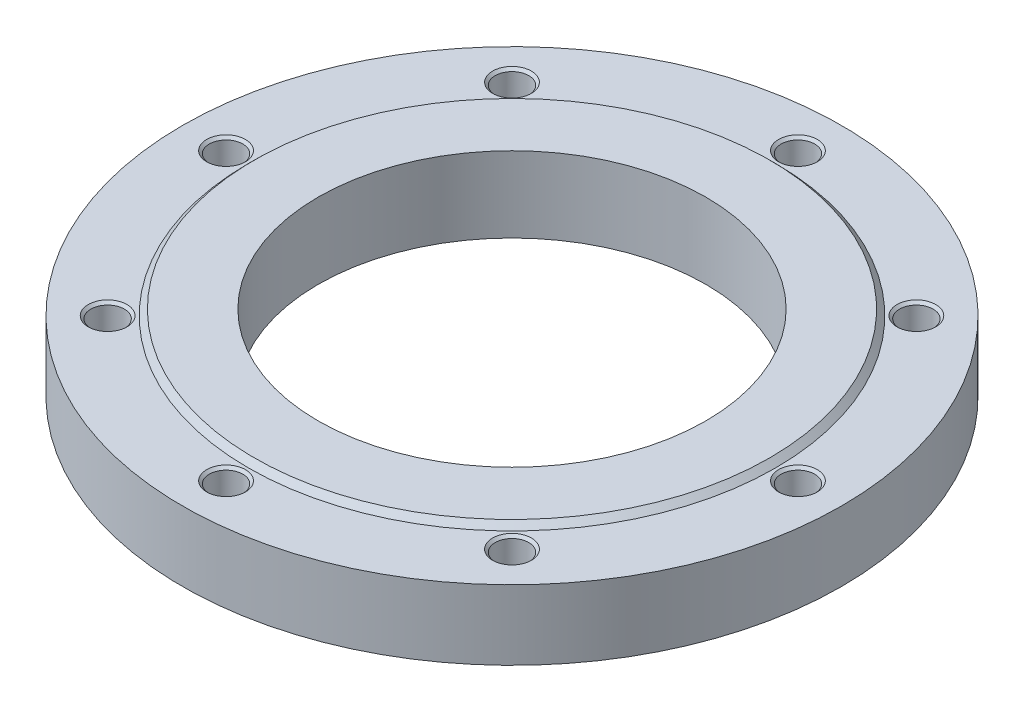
ISO-10303-21;
HEADER;
FILE_DESCRIPTION(('STEP AP214'),'2;1');
FILE_NAME('part.step','',(''),(''),'','','');
FILE_SCHEMA(('AUTOMOTIVE_DESIGN { 1 0 10303 214 1 1 1 1 }'));
ENDSEC;
DATA;
#1=APPLICATION_CONTEXT('core data for automotive mechanical design processes');
#2=APPLICATION_PROTOCOL_DEFINITION('international standard','automotive_design',2000,#1);
#3=PRODUCT_CONTEXT('',#1,'mechanical');
#4=PRODUCT('Part','Part','',(#3));
#5=PRODUCT_RELATED_PRODUCT_CATEGORY('part','',(#4));
#6=PRODUCT_DEFINITION_FORMATION('','',#4);
#7=PRODUCT_DEFINITION_CONTEXT('part definition',#1,'design');
#8=PRODUCT_DEFINITION('design','',#6,#7);
#9=PRODUCT_DEFINITION_SHAPE('','',#8);
#10=(LENGTH_UNIT() NAMED_UNIT(*) SI_UNIT(.MILLI.,.METRE.));
#11=(NAMED_UNIT(*) PLANE_ANGLE_UNIT() SI_UNIT($,.RADIAN.));
#12=(NAMED_UNIT(*) SI_UNIT($,.STERADIAN.) SOLID_ANGLE_UNIT());
#13=UNCERTAINTY_MEASURE_WITH_UNIT(LENGTH_MEASURE(1.E-05),#10,'distance_accuracy_value','');
#14=(GEOMETRIC_REPRESENTATION_CONTEXT(3) GLOBAL_UNCERTAINTY_ASSIGNED_CONTEXT((#13)) GLOBAL_UNIT_ASSIGNED_CONTEXT((#10,
#11,#12)) REPRESENTATION_CONTEXT('',''));
#15=CARTESIAN_POINT('',(0.,0.,0.));
#16=DIRECTION('',(0.,0.,1.));
#17=DIRECTION('',(1.,0.,0.));
#18=AXIS2_PLACEMENT_3D('',#15,#16,#17);
#19=CARTESIAN_POINT('',(0.,18.,0.));
#20=DIRECTION('',(0.,-1.,0.));
#21=DIRECTION('',(1.,0.,0.));
#22=AXIS2_PLACEMENT_3D('',#19,#20,#21);
#23=CYLINDRICAL_SURFACE('',#22,170.);
#24=CARTESIAN_POINT('',(0.,0.,0.));
#25=DIRECTION('',(0.,1.,0.));
#26=DIRECTION('',(1.,0.,0.));
#27=AXIS2_PLACEMENT_3D('',#24,#25,#26);
#28=CIRCLE('',#27,170.);
#29=CARTESIAN_POINT('',(170.,0.,0.));
#30=VERTEX_POINT('',#29);
#31=EDGE_CURVE('E9',#30,#30,#28,.T.);
#32=ORIENTED_EDGE('',*,*,#31,.T.);
#33=EDGE_LOOP('',(#32));
#34=FACE_BOUND('',#33,.T.);
#35=CARTESIAN_POINT('',(0.,36.,0.));
#36=DIRECTION('',(0.,1.,0.));
#37=DIRECTION('',(1.,0.,0.));
#38=AXIS2_PLACEMENT_3D('',#35,#36,#37);
#39=CIRCLE('',#38,170.);
#40=CARTESIAN_POINT('',(170.,36.,0.));
#41=VERTEX_POINT('',#40);
#42=EDGE_CURVE('E313',#41,#41,#39,.T.);
#43=ORIENTED_EDGE('',*,*,#42,.F.);
#44=EDGE_LOOP('',(#43));
#45=FACE_BOUND('',#44,.T.);
#46=ADVANCED_FACE('F15',(#34,#45),#23,.T.);
#47=CARTESIAN_POINT('',(135.,0.,0.));
#48=DIRECTION('',(0.,-1.,0.));
#49=DIRECTION('',(-1.,0.,0.));
#50=AXIS2_PLACEMENT_3D('',#47,#48,#49);
#51=PLANE('',#50);
#52=CARTESIAN_POINT('',(0.,0.,0.));
#53=DIRECTION('',(0.,1.,0.));
#54=DIRECTION('',(1.,0.,0.));
#55=AXIS2_PLACEMENT_3D('',#52,#53,#54);
#56=CIRCLE('',#55,100.);
#57=CARTESIAN_POINT('',(100.,0.,0.));
#58=VERTEX_POINT('',#57);
#59=EDGE_CURVE('E22',#58,#58,#56,.T.);
#60=ORIENTED_EDGE('',*,*,#59,.T.);
#61=EDGE_LOOP('',(#60));
#62=FACE_BOUND('',#61,.T.);
#63=ORIENTED_EDGE('',*,*,#31,.F.);
#64=EDGE_LOOP('',(#63));
#65=FACE_BOUND('',#64,.T.);
#66=ADVANCED_FACE('F335',(#62,#65),#51,.T.);
#67=CARTESIAN_POINT('',(0.,19.5,0.));
#68=DIRECTION('',(0.,-1.,0.));
#69=DIRECTION('',(1.,0.,0.));
#70=AXIS2_PLACEMENT_3D('',#67,#68,#69);
#71=CYLINDRICAL_SURFACE('',#70,100.);
#72=CARTESIAN_POINT('',(0.,39.,0.));
#73=DIRECTION('',(0.,1.,0.));
#74=DIRECTION('',(1.,0.,0.));
#75=AXIS2_PLACEMENT_3D('',#72,#73,#74);
#76=CIRCLE('',#75,100.);
#77=CARTESIAN_POINT('',(100.,39.,0.));
#78=VERTEX_POINT('',#77);
#79=EDGE_CURVE('E317',#78,#78,#76,.T.);
#80=ORIENTED_EDGE('',*,*,#79,.T.);
#81=EDGE_LOOP('',(#80));
#82=FACE_BOUND('',#81,.T.);
#83=ORIENTED_EDGE('',*,*,#59,.F.);
#84=EDGE_LOOP('',(#83));
#85=FACE_BOUND('',#84,.T.);
#86=ADVANCED_FACE('F320',(#82,#85),#71,.F.);
#87=CARTESIAN_POINT('',(116.5,39.,0.));
#88=DIRECTION('',(0.,1.,0.));
#89=DIRECTION('',(1.,0.,0.));
#90=AXIS2_PLACEMENT_3D('',#87,#88,#89);
#91=PLANE('',#90);
#92=CARTESIAN_POINT('',(0.,39.,0.));
#93=DIRECTION('',(0.,1.,0.));
#94=DIRECTION('',(1.,0.,0.));
#95=AXIS2_PLACEMENT_3D('',#92,#93,#94);
#96=CIRCLE('',#95,133.);
#97=CARTESIAN_POINT('',(133.,39.,0.));
#98=VERTEX_POINT('',#97);
#99=EDGE_CURVE('E315',#98,#98,#96,.T.);
#100=ORIENTED_EDGE('',*,*,#99,.T.);
#101=EDGE_LOOP('',(#100));
#102=FACE_BOUND('',#101,.T.);
#103=ORIENTED_EDGE('',*,*,#79,.F.);
#104=EDGE_LOOP('',(#103));
#105=FACE_BOUND('',#104,.T.);
#106=ADVANCED_FACE('F323',(#102,#105),#91,.T.);
#107=CARTESIAN_POINT('',(0.,37.5,0.));
#108=DIRECTION('',(0.,-1.,0.));
#109=DIRECTION('',(1.,0.,0.));
#110=AXIS2_PLACEMENT_3D('',#107,#108,#109);
#111=CONICAL_SURFACE('',#110,134.5,0.785398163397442);
#112=CARTESIAN_POINT('',(0.,36.,0.));
#113=DIRECTION('',(0.,1.,0.));
#114=DIRECTION('',(1.,0.,0.));
#115=AXIS2_PLACEMENT_3D('',#112,#113,#114);
#116=CIRCLE('',#115,136.);
#117=CARTESIAN_POINT('',(136.,36.,0.));
#118=VERTEX_POINT('',#117);
#119=EDGE_CURVE('E311',#118,#118,#116,.T.);
#120=ORIENTED_EDGE('',*,*,#119,.T.);
#121=EDGE_LOOP('',(#120));
#122=FACE_BOUND('',#121,.T.);
#123=ORIENTED_EDGE('',*,*,#99,.F.);
#124=EDGE_LOOP('',(#123));
#125=FACE_BOUND('',#124,.T.);
#126=ADVANCED_FACE('F325',(#122,#125),#111,.T.);
#127=CARTESIAN_POINT('',(153.,36.,0.));
#128=DIRECTION('',(0.,1.,0.));
#129=DIRECTION('',(1.,0.,0.));
#130=AXIS2_PLACEMENT_3D('',#127,#128,#129);
#131=PLANE('',#130);
#132=ORIENTED_EDGE('',*,*,#42,.T.);
#133=EDGE_LOOP('',(#132));
#134=FACE_BOUND('',#133,.T.);
#135=ORIENTED_EDGE('',*,*,#119,.F.);
#136=EDGE_LOOP('',(#135));
#137=FACE_BOUND('',#136,.T.);
#138=CARTESIAN_POINT('',(147.5,36.,0.));
#139=DIRECTION('',(0.,-1.,0.));
#140=DIRECTION('',(1.,0.,0.));
#141=AXIS2_PLACEMENT_3D('',#138,#139,#140);
#142=CIRCLE('',#141,10.);
#143=CARTESIAN_POINT('',(157.5,36.,0.));
#144=VERTEX_POINT('',#143);
#145=EDGE_CURVE('E301',#144,#144,#142,.T.);
#146=ORIENTED_EDGE('',*,*,#145,.T.);
#147=EDGE_LOOP('',(#146));
#148=FACE_BOUND('',#147,.T.);
#149=CARTESIAN_POINT('',(104.298250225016,36.,-104.298250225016));
#150=DIRECTION('',(0.,-1.,0.));
#151=DIRECTION('',(0.707106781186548,0.,-0.707106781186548));
#152=AXIS2_PLACEMENT_3D('',#149,#150,#151);
#153=CIRCLE('',#152,10.);
#154=CARTESIAN_POINT('',(111.369318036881,36.,-111.369318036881));
#155=VERTEX_POINT('',#154);
#156=EDGE_CURVE('E242',#155,#155,#153,.T.);
#157=ORIENTED_EDGE('',*,*,#156,.T.);
#158=EDGE_LOOP('',(#157));
#159=FACE_BOUND('',#158,.T.);
#160=CARTESIAN_POINT('',(0.,36.,-147.5));
#161=DIRECTION('',(0.,-1.,0.));
#162=DIRECTION('',(0.,0.,-1.));
#163=AXIS2_PLACEMENT_3D('',#160,#161,#162);
#164=CIRCLE('',#163,10.);
#165=CARTESIAN_POINT('',(0.,36.,-157.5));
#166=VERTEX_POINT('',#165);
#167=EDGE_CURVE('E282',#166,#166,#164,.T.);
#168=ORIENTED_EDGE('',*,*,#167,.T.);
#169=EDGE_LOOP('',(#168));
#170=FACE_BOUND('',#169,.T.);
#171=CARTESIAN_POINT('',(-104.298250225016,36.,-104.298250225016));
#172=DIRECTION('',(0.,-1.,0.));
#173=DIRECTION('',(-0.707106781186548,0.,-0.707106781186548));
#174=AXIS2_PLACEMENT_3D('',#171,#172,#173);
#175=CIRCLE('',#174,10.);
#176=CARTESIAN_POINT('',(-111.369318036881,36.,-111.369318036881));
#177=VERTEX_POINT('',#176);
#178=EDGE_CURVE('E271',#177,#177,#175,.T.);
#179=ORIENTED_EDGE('',*,*,#178,.T.);
#180=EDGE_LOOP('',(#179));
#181=FACE_BOUND('',#180,.T.);
#182=CARTESIAN_POINT('',(-147.5,36.,0.));
#183=DIRECTION('',(0.,-1.,0.));
#184=DIRECTION('',(-1.,0.,0.));
#185=AXIS2_PLACEMENT_3D('',#182,#183,#184);
#186=CIRCLE('',#185,10.);
#187=CARTESIAN_POINT('',(-157.5,36.,0.));
#188=VERTEX_POINT('',#187);
#189=EDGE_CURVE('E257',#188,#188,#186,.T.);
#190=ORIENTED_EDGE('',*,*,#189,.T.);
#191=EDGE_LOOP('',(#190));
#192=FACE_BOUND('',#191,.T.);
#193=CARTESIAN_POINT('',(-104.298250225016,36.,104.298250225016));
#194=DIRECTION('',(0.,-1.,0.));
#195=DIRECTION('',(-0.707106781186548,0.,0.707106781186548));
#196=AXIS2_PLACEMENT_3D('',#193,#194,#195);
#197=CIRCLE('',#196,10.);
#198=CARTESIAN_POINT('',(-111.369318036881,36.,111.369318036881));
#199=VERTEX_POINT('',#198);
#200=EDGE_CURVE('E230',#199,#199,#197,.T.);
#201=ORIENTED_EDGE('',*,*,#200,.T.);
#202=EDGE_LOOP('',(#201));
#203=FACE_BOUND('',#202,.T.);
#204=CARTESIAN_POINT('',(0.,36.,147.5));
#205=DIRECTION('',(0.,-1.,0.));
#206=DIRECTION('',(0.,0.,1.));
#207=AXIS2_PLACEMENT_3D('',#204,#205,#206);
#208=CIRCLE('',#207,10.);
#209=CARTESIAN_POINT('',(0.,36.,157.5));
#210=VERTEX_POINT('',#209);
#211=EDGE_CURVE('E211',#210,#210,#208,.T.);
#212=ORIENTED_EDGE('',*,*,#211,.T.);
#213=EDGE_LOOP('',(#212));
#214=FACE_BOUND('',#213,.T.);
#215=CARTESIAN_POINT('',(104.298250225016,36.,104.298250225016));
#216=DIRECTION('',(0.,-1.,0.));
#217=DIRECTION('',(0.707106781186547,0.,0.707106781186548));
#218=AXIS2_PLACEMENT_3D('',#215,#216,#217);
#219=CIRCLE('',#218,10.);
#220=CARTESIAN_POINT('',(111.369318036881,36.,111.369318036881));
#221=VERTEX_POINT('',#220);
#222=EDGE_CURVE('E227',#221,#221,#219,.T.);
#223=ORIENTED_EDGE('',*,*,#222,.T.);
#224=EDGE_LOOP('',(#223));
#225=FACE_BOUND('',#224,.T.);
#226=ADVANCED_FACE('F212',(#134,#137,#148,#159,#170,#181,#192,#203,#214,#225),#131,.T.);
#227=CARTESIAN_POINT('',(147.5,5.50386219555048,0.));
#228=DIRECTION('',(0.,1.,0.));
#229=DIRECTION('',(1.,0.,0.));
#230=AXIS2_PLACEMENT_3D('',#227,#228,#229);
#231=CONICAL_SURFACE('',#230,4.3234375,1.0471975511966);
#232=CARTESIAN_POINT('',(147.5,8.,0.));
#233=DIRECTION('',(0.,-1.,0.));
#234=DIRECTION('',(1.,0.,0.));
#235=AXIS2_PLACEMENT_3D('',#232,#233,#234);
#236=CIRCLE('',#235,8.646875);
#237=CARTESIAN_POINT('',(156.146875,8.,0.));
#238=VERTEX_POINT('',#237);
#239=EDGE_CURVE('E309',#238,#238,#236,.T.);
#240=ORIENTED_EDGE('',*,*,#239,.F.);
#241=EDGE_LOOP('',(#240));
#242=FACE_BOUND('',#241,.T.);
#243=CARTESIAN_POINT('',(147.5,3.00772439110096,0.));
#244=VERTEX_POINT('',#243);
#245=VERTEX_LOOP('',#244);
#246=FACE_BOUND('',#245,.T.);
#247=ADVANCED_FACE('F347',(#242,#246),#231,.F.);
#248=CARTESIAN_POINT('',(147.5,11.3234375,0.));
#249=DIRECTION('',(0.,1.,0.));
#250=DIRECTION('',(1.,0.,0.));
#251=AXIS2_PLACEMENT_3D('',#248,#249,#250);
#252=CYLINDRICAL_SURFACE('',#251,8.646875);
#253=CARTESIAN_POINT('',(147.5,14.646875,0.));
#254=DIRECTION('',(0.,-1.,0.));
#255=DIRECTION('',(1.,0.,0.));
#256=AXIS2_PLACEMENT_3D('',#253,#254,#255);
#257=CIRCLE('',#256,8.646875);
#258=CARTESIAN_POINT('',(156.146875,14.646875,0.));
#259=VERTEX_POINT('',#258);
#260=EDGE_CURVE('E307',#259,#259,#257,.T.);
#261=ORIENTED_EDGE('',*,*,#260,.F.);
#262=EDGE_LOOP('',(#261));
#263=FACE_BOUND('',#262,.T.);
#264=ORIENTED_EDGE('',*,*,#239,.T.);
#265=EDGE_LOOP('',(#264));
#266=FACE_BOUND('',#265,.T.);
#267=ADVANCED_FACE('F503',(#263,#266),#252,.F.);
#268=CARTESIAN_POINT('',(147.5,15.3234375,0.));
#269=DIRECTION('',(0.,1.,0.));
#270=DIRECTION('',(1.,0.,0.));
#271=AXIS2_PLACEMENT_3D('',#268,#269,#270);
#272=CONICAL_SURFACE('',#271,9.3234375,0.785398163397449);
#273=CARTESIAN_POINT('',(147.5,16.,0.));
#274=DIRECTION('',(0.,-1.,0.));
#275=DIRECTION('',(1.,0.,0.));
#276=AXIS2_PLACEMENT_3D('',#273,#274,#275);
#277=CIRCLE('',#276,10.);
#278=CARTESIAN_POINT('',(157.5,16.,0.));
#279=VERTEX_POINT('',#278);
#280=EDGE_CURVE('E305',#279,#279,#277,.T.);
#281=ORIENTED_EDGE('',*,*,#280,.F.);
#282=EDGE_LOOP('',(#281));
#283=FACE_BOUND('',#282,.T.);
#284=ORIENTED_EDGE('',*,*,#260,.T.);
#285=EDGE_LOOP('',(#284));
#286=FACE_BOUND('',#285,.T.);
#287=ADVANCED_FACE('F499',(#283,#286),#272,.F.);
#288=CARTESIAN_POINT('',(156.8234375,16.,0.));
#289=DIRECTION('',(0.,1.,0.));
#290=DIRECTION('',(-1.,0.,0.));
#291=AXIS2_PLACEMENT_3D('',#288,#289,#290);
#292=PLANE('',#291);
#293=CARTESIAN_POINT('',(147.5,16.,0.));
#294=DIRECTION('',(0.,-1.,0.));
#295=DIRECTION('',(1.,0.,0.));
#296=AXIS2_PLACEMENT_3D('',#293,#294,#295);
#297=CIRCLE('',#296,8.646875);
#298=CARTESIAN_POINT('',(156.146875,16.,0.));
#299=VERTEX_POINT('',#298);
#300=EDGE_CURVE('E303',#299,#299,#297,.T.);
#301=ORIENTED_EDGE('',*,*,#300,.F.);
#302=EDGE_LOOP('',(#301));
#303=FACE_BOUND('',#302,.T.);
#304=ORIENTED_EDGE('',*,*,#280,.T.);
#305=EDGE_LOOP('',(#304));
#306=FACE_BOUND('',#305,.T.);
#307=ADVANCED_FACE('F495',(#303,#306),#292,.F.);
#308=CARTESIAN_POINT('',(147.5,25.3234375,0.));
#309=DIRECTION('',(0.,1.,0.));
#310=DIRECTION('',(1.,0.,0.));
#311=AXIS2_PLACEMENT_3D('',#308,#309,#310);
#312=CYLINDRICAL_SURFACE('',#311,8.646875);
#313=CARTESIAN_POINT('',(147.5,34.646875,0.));
#314=DIRECTION('',(0.,-1.,0.));
#315=DIRECTION('',(1.,0.,0.));
#316=AXIS2_PLACEMENT_3D('',#313,#314,#315);
#317=CIRCLE('',#316,8.646875);
#318=CARTESIAN_POINT('',(156.146875,34.646875,0.));
#319=VERTEX_POINT('',#318);
#320=EDGE_CURVE('E299',#319,#319,#317,.T.);
#321=ORIENTED_EDGE('',*,*,#320,.F.);
#322=EDGE_LOOP('',(#321));
#323=FACE_BOUND('',#322,.T.);
#324=ORIENTED_EDGE('',*,*,#300,.T.);
#325=EDGE_LOOP('',(#324));
#326=FACE_BOUND('',#325,.T.);
#327=ADVANCED_FACE('F491',(#323,#326),#312,.F.);
#328=CARTESIAN_POINT('',(147.5,35.3234375,0.));
#329=DIRECTION('',(0.,1.,0.));
#330=DIRECTION('',(1.,0.,0.));
#331=AXIS2_PLACEMENT_3D('',#328,#329,#330);
#332=CONICAL_SURFACE('',#331,9.3234375,0.785398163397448);
#333=ORIENTED_EDGE('',*,*,#145,.F.);
#334=EDGE_LOOP('',(#333));
#335=FACE_BOUND('',#334,.T.);
#336=ORIENTED_EDGE('',*,*,#320,.T.);
#337=EDGE_LOOP('',(#336));
#338=FACE_BOUND('',#337,.T.);
#339=ADVANCED_FACE('F487',(#335,#338),#332,.F.);
#340=CARTESIAN_POINT('',(104.298250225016,5.50386219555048,-104.298250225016));
#341=DIRECTION('',(0.,1.,0.));
#342=DIRECTION('',(0.707106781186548,0.,-0.707106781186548));
#343=AXIS2_PLACEMENT_3D('',#340,#341,#342);
#344=CONICAL_SURFACE('',#343,4.3234375,1.0471975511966);
#345=CARTESIAN_POINT('',(104.298250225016,8.,-104.298250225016));
#346=DIRECTION('',(0.,-1.,0.));
#347=DIRECTION('',(0.707106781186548,0.,-0.707106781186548));
#348=AXIS2_PLACEMENT_3D('',#345,#346,#347);
#349=CIRCLE('',#348,8.646875);
#350=CARTESIAN_POINT('',(110.412514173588,8.,-110.412514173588));
#351=VERTEX_POINT('',#350);
#352=EDGE_CURVE('E297',#351,#351,#349,.T.);
#353=ORIENTED_EDGE('',*,*,#352,.F.);
#354=EDGE_LOOP('',(#353));
#355=FACE_BOUND('',#354,.T.);
#356=CARTESIAN_POINT('',(104.298250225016,3.00772439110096,-104.298250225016));
#357=VERTEX_POINT('',#356);
#358=VERTEX_LOOP('',#357);
#359=FACE_BOUND('',#358,.T.);
#360=ADVANCED_FACE('F483',(#355,#359),#344,.F.);
#361=CARTESIAN_POINT('',(104.298250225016,11.3234375,-104.298250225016));
#362=DIRECTION('',(0.,1.,0.));
#363=DIRECTION('',(0.707106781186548,0.,-0.707106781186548));
#364=AXIS2_PLACEMENT_3D('',#361,#362,#363);
#365=CYLINDRICAL_SURFACE('',#364,8.646875);
#366=CARTESIAN_POINT('',(104.298250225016,14.646875,-104.298250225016));
#367=DIRECTION('',(0.,-1.,0.));
#368=DIRECTION('',(0.707106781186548,0.,-0.707106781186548));
#369=AXIS2_PLACEMENT_3D('',#366,#367,#368);
#370=CIRCLE('',#369,8.646875);
#371=CARTESIAN_POINT('',(110.412514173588,14.646875,-110.412514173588));
#372=VERTEX_POINT('',#371);
#373=EDGE_CURVE('E295',#372,#372,#370,.T.);
#374=ORIENTED_EDGE('',*,*,#373,.F.);
#375=EDGE_LOOP('',(#374));
#376=FACE_BOUND('',#375,.T.);
#377=ORIENTED_EDGE('',*,*,#352,.T.);
#378=EDGE_LOOP('',(#377));
#379=FACE_BOUND('',#378,.T.);
#380=ADVANCED_FACE('F479',(#376,#379),#365,.F.);
#381=CARTESIAN_POINT('',(104.298250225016,15.3234375,-104.298250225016));
#382=DIRECTION('',(0.,1.,0.));
#383=DIRECTION('',(0.707106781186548,0.,-0.707106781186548));
#384=AXIS2_PLACEMENT_3D('',#381,#382,#383);
#385=CONICAL_SURFACE('',#384,9.3234375,0.785398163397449);
#386=CARTESIAN_POINT('',(104.298250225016,16.,-104.298250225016));
#387=DIRECTION('',(0.,-1.,0.));
#388=DIRECTION('',(0.707106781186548,0.,-0.707106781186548));
#389=AXIS2_PLACEMENT_3D('',#386,#387,#388);
#390=CIRCLE('',#389,10.);
#391=CARTESIAN_POINT('',(111.369318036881,16.,-111.369318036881));
#392=VERTEX_POINT('',#391);
#393=EDGE_CURVE('E293',#392,#392,#390,.T.);
#394=ORIENTED_EDGE('',*,*,#393,.F.);
#395=EDGE_LOOP('',(#394));
#396=FACE_BOUND('',#395,.T.);
#397=ORIENTED_EDGE('',*,*,#373,.T.);
#398=EDGE_LOOP('',(#397));
#399=FACE_BOUND('',#398,.T.);
#400=ADVANCED_FACE('F475',(#396,#399),#385,.F.);
#401=CARTESIAN_POINT('',(110.890916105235,16.,-110.890916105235));
#402=DIRECTION('',(0.,1.,0.));
#403=DIRECTION('',(-0.707106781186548,0.,0.707106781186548));
#404=AXIS2_PLACEMENT_3D('',#401,#402,#403);
#405=PLANE('',#404);
#406=CARTESIAN_POINT('',(104.298250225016,16.,-104.298250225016));
#407=DIRECTION('',(0.,-1.,0.));
#408=DIRECTION('',(0.707106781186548,0.,-0.707106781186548));
#409=AXIS2_PLACEMENT_3D('',#406,#407,#408);
#410=CIRCLE('',#409,8.646875);
#411=CARTESIAN_POINT('',(110.412514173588,16.,-110.412514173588));
#412=VERTEX_POINT('',#411);
#413=EDGE_CURVE('E291',#412,#412,#410,.T.);
#414=ORIENTED_EDGE('',*,*,#413,.F.);
#415=EDGE_LOOP('',(#414));
#416=FACE_BOUND('',#415,.T.);
#417=ORIENTED_EDGE('',*,*,#393,.T.);
#418=EDGE_LOOP('',(#417));
#419=FACE_BOUND('',#418,.T.);
#420=ADVANCED_FACE('F471',(#416,#419),#405,.F.);
#421=CARTESIAN_POINT('',(104.298250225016,25.3234375,-104.298250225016));
#422=DIRECTION('',(0.,1.,0.));
#423=DIRECTION('',(0.707106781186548,0.,-0.707106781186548));
#424=AXIS2_PLACEMENT_3D('',#421,#422,#423);
#425=CYLINDRICAL_SURFACE('',#424,8.646875);
#426=CARTESIAN_POINT('',(104.298250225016,34.646875,-104.298250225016));
#427=DIRECTION('',(0.,-1.,0.));
#428=DIRECTION('',(0.707106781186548,0.,-0.707106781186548));
#429=AXIS2_PLACEMENT_3D('',#426,#427,#428);
#430=CIRCLE('',#429,8.646875);
#431=CARTESIAN_POINT('',(110.412514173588,34.646875,-110.412514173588));
#432=VERTEX_POINT('',#431);
#433=EDGE_CURVE('E240',#432,#432,#430,.T.);
#434=ORIENTED_EDGE('',*,*,#433,.F.);
#435=EDGE_LOOP('',(#434));
#436=FACE_BOUND('',#435,.T.);
#437=ORIENTED_EDGE('',*,*,#413,.T.);
#438=EDGE_LOOP('',(#437));
#439=FACE_BOUND('',#438,.T.);
#440=ADVANCED_FACE('F467',(#436,#439),#425,.F.);
#441=CARTESIAN_POINT('',(104.298250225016,35.3234375,-104.298250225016));
#442=DIRECTION('',(0.,1.,0.));
#443=DIRECTION('',(0.707106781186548,0.,-0.707106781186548));
#444=AXIS2_PLACEMENT_3D('',#441,#442,#443);
#445=CONICAL_SURFACE('',#444,9.3234375,0.785398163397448);
#446=ORIENTED_EDGE('',*,*,#156,.F.);
#447=EDGE_LOOP('',(#446));
#448=FACE_BOUND('',#447,.T.);
#449=ORIENTED_EDGE('',*,*,#433,.T.);
#450=EDGE_LOOP('',(#449));
#451=FACE_BOUND('',#450,.T.);
#452=ADVANCED_FACE('F470',(#448,#451),#445,.F.);
#453=CARTESIAN_POINT('',(0.,5.50386219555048,-147.5));
#454=DIRECTION('',(0.,1.,0.));
#455=DIRECTION('',(0.,0.,-1.));
#456=AXIS2_PLACEMENT_3D('',#453,#454,#455);
#457=CONICAL_SURFACE('',#456,4.3234375,1.0471975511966);
#458=CARTESIAN_POINT('',(0.,8.,-147.5));
#459=DIRECTION('',(0.,-1.,0.));
#460=DIRECTION('',(0.,0.,-1.));
#461=AXIS2_PLACEMENT_3D('',#458,#459,#460);
#462=CIRCLE('',#461,8.646875);
#463=CARTESIAN_POINT('',(0.,8.,-156.146875));
#464=VERTEX_POINT('',#463);
#465=EDGE_CURVE('E243',#464,#464,#462,.T.);
#466=ORIENTED_EDGE('',*,*,#465,.F.);
#467=EDGE_LOOP('',(#466));
#468=FACE_BOUND('',#467,.T.);
#469=CARTESIAN_POINT('',(0.,3.00772439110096,-147.5));
#470=VERTEX_POINT('',#469);
#471=VERTEX_LOOP('',#470);
#472=FACE_BOUND('',#471,.T.);
#473=ADVANCED_FACE('F465',(#468,#472),#457,.F.);
#474=CARTESIAN_POINT('',(0.,11.3234375,-147.5));
#475=DIRECTION('',(0.,1.,0.));
#476=DIRECTION('',(0.,0.,-1.));
#477=AXIS2_PLACEMENT_3D('',#474,#475,#476);
#478=CYLINDRICAL_SURFACE('',#477,8.646875);
#479=CARTESIAN_POINT('',(0.,14.646875,-147.5));
#480=DIRECTION('',(0.,-1.,0.));
#481=DIRECTION('',(0.,0.,-1.));
#482=AXIS2_PLACEMENT_3D('',#479,#480,#481);
#483=CIRCLE('',#482,8.646875);
#484=CARTESIAN_POINT('',(0.,14.646875,-156.146875));
#485=VERTEX_POINT('',#484);
#486=EDGE_CURVE('E269',#485,#485,#483,.T.);
#487=ORIENTED_EDGE('',*,*,#486,.F.);
#488=EDGE_LOOP('',(#487));
#489=FACE_BOUND('',#488,.T.);
#490=ORIENTED_EDGE('',*,*,#465,.T.);
#491=EDGE_LOOP('',(#490));
#492=FACE_BOUND('',#491,.T.);
#493=ADVANCED_FACE('F461',(#489,#492),#478,.F.);
#494=CARTESIAN_POINT('',(0.,15.3234375,-147.5));
#495=DIRECTION('',(0.,1.,0.));
#496=DIRECTION('',(0.,0.,-1.));
#497=AXIS2_PLACEMENT_3D('',#494,#495,#496);
#498=CONICAL_SURFACE('',#497,9.3234375,0.785398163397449);
#499=CARTESIAN_POINT('',(0.,16.,-147.5));
#500=DIRECTION('',(0.,-1.,0.));
#501=DIRECTION('',(0.,0.,-1.));
#502=AXIS2_PLACEMENT_3D('',#499,#500,#501);
#503=CIRCLE('',#502,10.);
#504=CARTESIAN_POINT('',(0.,16.,-157.5));
#505=VERTEX_POINT('',#504);
#506=EDGE_CURVE('E287',#505,#505,#503,.T.);
#507=ORIENTED_EDGE('',*,*,#506,.F.);
#508=EDGE_LOOP('',(#507));
#509=FACE_BOUND('',#508,.T.);
#510=ORIENTED_EDGE('',*,*,#486,.T.);
#511=EDGE_LOOP('',(#510));
#512=FACE_BOUND('',#511,.T.);
#513=ADVANCED_FACE('F457',(#509,#512),#498,.F.);
#514=CARTESIAN_POINT('',(0.,16.,-156.8234375));
#515=DIRECTION('',(0.,1.,0.));
#516=DIRECTION('',(0.,0.,1.));
#517=AXIS2_PLACEMENT_3D('',#514,#515,#516);
#518=PLANE('',#517);
#519=CARTESIAN_POINT('',(0.,16.,-147.5));
#520=DIRECTION('',(0.,-1.,0.));
#521=DIRECTION('',(0.,0.,-1.));
#522=AXIS2_PLACEMENT_3D('',#519,#520,#521);
#523=CIRCLE('',#522,8.646875);
#524=CARTESIAN_POINT('',(0.,16.,-156.146875));
#525=VERTEX_POINT('',#524);
#526=EDGE_CURVE('E285',#525,#525,#523,.T.);
#527=ORIENTED_EDGE('',*,*,#526,.F.);
#528=EDGE_LOOP('',(#527));
#529=FACE_BOUND('',#528,.T.);
#530=ORIENTED_EDGE('',*,*,#506,.T.);
#531=EDGE_LOOP('',(#530));
#532=FACE_BOUND('',#531,.T.);
#533=ADVANCED_FACE('F453',(#529,#532),#518,.F.);
#534=CARTESIAN_POINT('',(0.,25.3234375,-147.5));
#535=DIRECTION('',(0.,1.,0.));
#536=DIRECTION('',(0.,0.,-1.));
#537=AXIS2_PLACEMENT_3D('',#534,#535,#536);
#538=CYLINDRICAL_SURFACE('',#537,8.646875);
#539=CARTESIAN_POINT('',(0.,34.646875,-147.5));
#540=DIRECTION('',(0.,-1.,0.));
#541=DIRECTION('',(0.,0.,-1.));
#542=AXIS2_PLACEMENT_3D('',#539,#540,#541);
#543=CIRCLE('',#542,8.646875);
#544=CARTESIAN_POINT('',(0.,34.646875,-156.146875));
#545=VERTEX_POINT('',#544);
#546=EDGE_CURVE('E280',#545,#545,#543,.T.);
#547=ORIENTED_EDGE('',*,*,#546,.F.);
#548=EDGE_LOOP('',(#547));
#549=FACE_BOUND('',#548,.T.);
#550=ORIENTED_EDGE('',*,*,#526,.T.);
#551=EDGE_LOOP('',(#550));
#552=FACE_BOUND('',#551,.T.);
#553=ADVANCED_FACE('F450',(#549,#552),#538,.F.);
#554=CARTESIAN_POINT('',(0.,35.3234375,-147.5));
#555=DIRECTION('',(0.,1.,0.));
#556=DIRECTION('',(0.,0.,-1.));
#557=AXIS2_PLACEMENT_3D('',#554,#555,#556);
#558=CONICAL_SURFACE('',#557,9.3234375,0.785398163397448);
#559=ORIENTED_EDGE('',*,*,#167,.F.);
#560=EDGE_LOOP('',(#559));
#561=FACE_BOUND('',#560,.T.);
#562=ORIENTED_EDGE('',*,*,#546,.T.);
#563=EDGE_LOOP('',(#562));
#564=FACE_BOUND('',#563,.T.);
#565=ADVANCED_FACE('F448',(#561,#564),#558,.F.);
#566=CARTESIAN_POINT('',(-104.298250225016,5.50386219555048,-104.298250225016));
#567=DIRECTION('',(0.,1.,0.));
#568=DIRECTION('',(-0.707106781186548,0.,-0.707106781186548));
#569=AXIS2_PLACEMENT_3D('',#566,#567,#568);
#570=CONICAL_SURFACE('',#569,4.3234375,1.0471975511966);
#571=CARTESIAN_POINT('',(-104.298250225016,8.,-104.298250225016));
#572=DIRECTION('',(0.,-1.,0.));
#573=DIRECTION('',(-0.707106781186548,0.,-0.707106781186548));
#574=AXIS2_PLACEMENT_3D('',#571,#572,#573);
#575=CIRCLE('',#574,8.646875);
#576=CARTESIAN_POINT('',(-110.412514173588,8.,-110.412514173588));
#577=VERTEX_POINT('',#576);
#578=EDGE_CURVE('E279',#577,#577,#575,.T.);
#579=ORIENTED_EDGE('',*,*,#578,.F.);
#580=EDGE_LOOP('',(#579));
#581=FACE_BOUND('',#580,.T.);
#582=CARTESIAN_POINT('',(-104.298250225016,3.00772439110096,-104.298250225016));
#583=VERTEX_POINT('',#582);
#584=VERTEX_LOOP('',#583);
#585=FACE_BOUND('',#584,.T.);
#586=ADVANCED_FACE('F444',(#581,#585),#570,.F.);
#587=CARTESIAN_POINT('',(-104.298250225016,11.3234375,-104.298250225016));
#588=DIRECTION('',(0.,1.,0.));
#589=DIRECTION('',(-0.707106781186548,0.,-0.707106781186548));
#590=AXIS2_PLACEMENT_3D('',#587,#588,#589);
#591=CYLINDRICAL_SURFACE('',#590,8.646875);
#592=CARTESIAN_POINT('',(-104.298250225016,14.646875,-104.298250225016));
#593=DIRECTION('',(0.,-1.,0.));
#594=DIRECTION('',(-0.707106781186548,0.,-0.707106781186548));
#595=AXIS2_PLACEMENT_3D('',#592,#593,#594);
#596=CIRCLE('',#595,8.646875);
#597=CARTESIAN_POINT('',(-110.412514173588,14.646875,-110.412514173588));
#598=VERTEX_POINT('',#597);
#599=EDGE_CURVE('E277',#598,#598,#596,.T.);
#600=ORIENTED_EDGE('',*,*,#599,.F.);
#601=EDGE_LOOP('',(#600));
#602=FACE_BOUND('',#601,.T.);
#603=ORIENTED_EDGE('',*,*,#578,.T.);
#604=EDGE_LOOP('',(#603));
#605=FACE_BOUND('',#604,.T.);
#606=ADVANCED_FACE('F440',(#602,#605),#591,.F.);
#607=CARTESIAN_POINT('',(-104.298250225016,15.3234375,-104.298250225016));
#608=DIRECTION('',(0.,1.,0.));
#609=DIRECTION('',(-0.707106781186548,0.,-0.707106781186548));
#610=AXIS2_PLACEMENT_3D('',#607,#608,#609);
#611=CONICAL_SURFACE('',#610,9.3234375,0.785398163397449);
#612=CARTESIAN_POINT('',(-104.298250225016,16.,-104.298250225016));
#613=DIRECTION('',(0.,-1.,0.));
#614=DIRECTION('',(-0.707106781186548,0.,-0.707106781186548));
#615=AXIS2_PLACEMENT_3D('',#612,#613,#614);
#616=CIRCLE('',#615,10.);
#617=CARTESIAN_POINT('',(-111.369318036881,16.,-111.369318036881));
#618=VERTEX_POINT('',#617);
#619=EDGE_CURVE('E275',#618,#618,#616,.T.);
#620=ORIENTED_EDGE('',*,*,#619,.F.);
#621=EDGE_LOOP('',(#620));
#622=FACE_BOUND('',#621,.T.);
#623=ORIENTED_EDGE('',*,*,#599,.T.);
#624=EDGE_LOOP('',(#623));
#625=FACE_BOUND('',#624,.T.);
#626=ADVANCED_FACE('F436',(#622,#625),#611,.F.);
#627=CARTESIAN_POINT('',(-110.890916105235,16.,-110.890916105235));
#628=DIRECTION('',(0.,1.,0.));
#629=DIRECTION('',(0.707106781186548,0.,0.707106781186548));
#630=AXIS2_PLACEMENT_3D('',#627,#628,#629);
#631=PLANE('',#630);
#632=CARTESIAN_POINT('',(-104.298250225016,16.,-104.298250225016));
#633=DIRECTION('',(0.,-1.,0.));
#634=DIRECTION('',(-0.707106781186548,0.,-0.707106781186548));
#635=AXIS2_PLACEMENT_3D('',#632,#633,#634);
#636=CIRCLE('',#635,8.646875);
#637=CARTESIAN_POINT('',(-110.412514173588,16.,-110.412514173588));
#638=VERTEX_POINT('',#637);
#639=EDGE_CURVE('E273',#638,#638,#636,.T.);
#640=ORIENTED_EDGE('',*,*,#639,.F.);
#641=EDGE_LOOP('',(#640));
#642=FACE_BOUND('',#641,.T.);
#643=ORIENTED_EDGE('',*,*,#619,.T.);
#644=EDGE_LOOP('',(#643));
#645=FACE_BOUND('',#644,.T.);
#646=ADVANCED_FACE('F431',(#642,#645),#631,.F.);
#647=CARTESIAN_POINT('',(-104.298250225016,25.3234375,-104.298250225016));
#648=DIRECTION('',(0.,1.,0.));
#649=DIRECTION('',(-0.707106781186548,0.,-0.707106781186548));
#650=AXIS2_PLACEMENT_3D('',#647,#648,#649);
#651=CYLINDRICAL_SURFACE('',#650,8.646875);
#652=CARTESIAN_POINT('',(-104.298250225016,34.646875,-104.298250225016));
#653=DIRECTION('',(0.,-1.,0.));
#654=DIRECTION('',(-0.707106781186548,0.,-0.707106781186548));
#655=AXIS2_PLACEMENT_3D('',#652,#653,#654);
#656=CIRCLE('',#655,8.646875);
#657=CARTESIAN_POINT('',(-110.412514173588,34.646875,-110.412514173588));
#658=VERTEX_POINT('',#657);
#659=EDGE_CURVE('E267',#658,#658,#656,.T.);
#660=ORIENTED_EDGE('',*,*,#659,.F.);
#661=EDGE_LOOP('',(#660));
#662=FACE_BOUND('',#661,.T.);
#663=ORIENTED_EDGE('',*,*,#639,.T.);
#664=EDGE_LOOP('',(#663));
#665=FACE_BOUND('',#664,.T.);
#666=ADVANCED_FACE('F428',(#662,#665),#651,.F.);
#667=CARTESIAN_POINT('',(-104.298250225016,35.3234375,-104.298250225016));
#668=DIRECTION('',(0.,1.,0.));
#669=DIRECTION('',(-0.707106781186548,0.,-0.707106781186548));
#670=AXIS2_PLACEMENT_3D('',#667,#668,#669);
#671=CONICAL_SURFACE('',#670,9.3234375,0.785398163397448);
#672=ORIENTED_EDGE('',*,*,#178,.F.);
#673=EDGE_LOOP('',(#672));
#674=FACE_BOUND('',#673,.T.);
#675=ORIENTED_EDGE('',*,*,#659,.T.);
#676=EDGE_LOOP('',(#675));
#677=FACE_BOUND('',#676,.T.);
#678=ADVANCED_FACE('F424',(#674,#677),#671,.F.);
#679=CARTESIAN_POINT('',(-147.5,5.50386219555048,0.));
#680=DIRECTION('',(0.,1.,0.));
#681=DIRECTION('',(-1.,0.,0.));
#682=AXIS2_PLACEMENT_3D('',#679,#680,#681);
#683=CONICAL_SURFACE('',#682,4.3234375,1.0471975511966);
#684=CARTESIAN_POINT('',(-147.5,8.,0.));
#685=DIRECTION('',(0.,-1.,0.));
#686=DIRECTION('',(-1.,0.,0.));
#687=AXIS2_PLACEMENT_3D('',#684,#685,#686);
#688=CIRCLE('',#687,8.646875);
#689=CARTESIAN_POINT('',(-156.146875,8.,0.));
#690=VERTEX_POINT('',#689);
#691=EDGE_CURVE('E265',#690,#690,#688,.T.);
#692=ORIENTED_EDGE('',*,*,#691,.F.);
#693=EDGE_LOOP('',(#692));
#694=FACE_BOUND('',#693,.T.);
#695=CARTESIAN_POINT('',(-147.5,3.00772439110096,0.));
#696=VERTEX_POINT('',#695);
#697=VERTEX_LOOP('',#696);
#698=FACE_BOUND('',#697,.T.);
#699=ADVANCED_FACE('F420',(#694,#698),#683,.F.);
#700=CARTESIAN_POINT('',(-147.5,11.3234375,0.));
#701=DIRECTION('',(0.,1.,0.));
#702=DIRECTION('',(-1.,0.,0.));
#703=AXIS2_PLACEMENT_3D('',#700,#701,#702);
#704=CYLINDRICAL_SURFACE('',#703,8.646875);
#705=CARTESIAN_POINT('',(-147.5,14.646875,0.));
#706=DIRECTION('',(0.,-1.,0.));
#707=DIRECTION('',(-1.,0.,0.));
#708=AXIS2_PLACEMENT_3D('',#705,#706,#707);
#709=CIRCLE('',#708,8.646875);
#710=CARTESIAN_POINT('',(-156.146875,14.646875,0.));
#711=VERTEX_POINT('',#710);
#712=EDGE_CURVE('E263',#711,#711,#709,.T.);
#713=ORIENTED_EDGE('',*,*,#712,.F.);
#714=EDGE_LOOP('',(#713));
#715=FACE_BOUND('',#714,.T.);
#716=ORIENTED_EDGE('',*,*,#691,.T.);
#717=EDGE_LOOP('',(#716));
#718=FACE_BOUND('',#717,.T.);
#719=ADVANCED_FACE('F416',(#715,#718),#704,.F.);
#720=CARTESIAN_POINT('',(-147.5,15.3234375,0.));
#721=DIRECTION('',(0.,1.,0.));
#722=DIRECTION('',(-1.,0.,0.));
#723=AXIS2_PLACEMENT_3D('',#720,#721,#722);
#724=CONICAL_SURFACE('',#723,9.3234375,0.785398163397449);
#725=CARTESIAN_POINT('',(-147.5,16.,0.));
#726=DIRECTION('',(0.,-1.,0.));
#727=DIRECTION('',(-1.,0.,0.));
#728=AXIS2_PLACEMENT_3D('',#725,#726,#727);
#729=CIRCLE('',#728,10.);
#730=CARTESIAN_POINT('',(-157.5,16.,0.));
#731=VERTEX_POINT('',#730);
#732=EDGE_CURVE('E261',#731,#731,#729,.T.);
#733=ORIENTED_EDGE('',*,*,#732,.F.);
#734=EDGE_LOOP('',(#733));
#735=FACE_BOUND('',#734,.T.);
#736=ORIENTED_EDGE('',*,*,#712,.T.);
#737=EDGE_LOOP('',(#736));
#738=FACE_BOUND('',#737,.T.);
#739=ADVANCED_FACE('F412',(#735,#738),#724,.F.);
#740=CARTESIAN_POINT('',(-156.8234375,16.,0.));
#741=DIRECTION('',(0.,1.,0.));
#742=DIRECTION('',(1.,0.,0.));
#743=AXIS2_PLACEMENT_3D('',#740,#741,#742);
#744=PLANE('',#743);
#745=CARTESIAN_POINT('',(-147.5,16.,0.));
#746=DIRECTION('',(0.,-1.,0.));
#747=DIRECTION('',(-1.,0.,0.));
#748=AXIS2_PLACEMENT_3D('',#745,#746,#747);
#749=CIRCLE('',#748,8.646875);
#750=CARTESIAN_POINT('',(-156.146875,16.,0.));
#751=VERTEX_POINT('',#750);
#752=EDGE_CURVE('E259',#751,#751,#749,.T.);
#753=ORIENTED_EDGE('',*,*,#752,.F.);
#754=EDGE_LOOP('',(#753));
#755=FACE_BOUND('',#754,.T.);
#756=ORIENTED_EDGE('',*,*,#732,.T.);
#757=EDGE_LOOP('',(#756));
#758=FACE_BOUND('',#757,.T.);
#759=ADVANCED_FACE('F408',(#755,#758),#744,.F.);
#760=CARTESIAN_POINT('',(-147.5,25.3234375,0.));
#761=DIRECTION('',(0.,1.,0.));
#762=DIRECTION('',(-1.,0.,0.));
#763=AXIS2_PLACEMENT_3D('',#760,#761,#762);
#764=CYLINDRICAL_SURFACE('',#763,8.646875);
#765=CARTESIAN_POINT('',(-147.5,34.646875,0.));
#766=DIRECTION('',(0.,-1.,0.));
#767=DIRECTION('',(-1.,0.,0.));
#768=AXIS2_PLACEMENT_3D('',#765,#766,#767);
#769=CIRCLE('',#768,8.646875);
#770=CARTESIAN_POINT('',(-156.146875,34.646875,0.));
#771=VERTEX_POINT('',#770);
#772=EDGE_CURVE('E255',#771,#771,#769,.T.);
#773=ORIENTED_EDGE('',*,*,#772,.F.);
#774=EDGE_LOOP('',(#773));
#775=FACE_BOUND('',#774,.T.);
#776=ORIENTED_EDGE('',*,*,#752,.T.);
#777=EDGE_LOOP('',(#776));
#778=FACE_BOUND('',#777,.T.);
#779=ADVANCED_FACE('F402',(#775,#778),#764,.F.);
#780=CARTESIAN_POINT('',(-147.5,35.3234375,0.));
#781=DIRECTION('',(0.,1.,0.));
#782=DIRECTION('',(-1.,0.,0.));
#783=AXIS2_PLACEMENT_3D('',#780,#781,#782);
#784=CONICAL_SURFACE('',#783,9.3234375,0.785398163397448);
#785=ORIENTED_EDGE('',*,*,#189,.F.);
#786=EDGE_LOOP('',(#785));
#787=FACE_BOUND('',#786,.T.);
#788=ORIENTED_EDGE('',*,*,#772,.T.);
#789=EDGE_LOOP('',(#788));
#790=FACE_BOUND('',#789,.T.);
#791=ADVANCED_FACE('F397',(#787,#790),#784,.F.);
#792=CARTESIAN_POINT('',(-104.298250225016,5.50386219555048,104.298250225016));
#793=DIRECTION('',(0.,1.,0.));
#794=DIRECTION('',(-0.707106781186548,0.,0.707106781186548));
#795=AXIS2_PLACEMENT_3D('',#792,#793,#794);
#796=CONICAL_SURFACE('',#795,4.3234375,1.0471975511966);
#797=CARTESIAN_POINT('',(-104.298250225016,8.,104.298250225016));
#798=DIRECTION('',(0.,-1.,0.));
#799=DIRECTION('',(-0.707106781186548,0.,0.707106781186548));
#800=AXIS2_PLACEMENT_3D('',#797,#798,#799);
#801=CIRCLE('',#800,8.646875);
#802=CARTESIAN_POINT('',(-110.412514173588,8.,110.412514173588));
#803=VERTEX_POINT('',#802);
#804=EDGE_CURVE('E253',#803,#803,#801,.T.);
#805=ORIENTED_EDGE('',*,*,#804,.F.);
#806=EDGE_LOOP('',(#805));
#807=FACE_BOUND('',#806,.T.);
#808=CARTESIAN_POINT('',(-104.298250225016,3.00772439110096,104.298250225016));
#809=VERTEX_POINT('',#808);
#810=VERTEX_LOOP('',#809);
#811=FACE_BOUND('',#810,.T.);
#812=ADVANCED_FACE('F391',(#807,#811),#796,.F.);
#813=CARTESIAN_POINT('',(-104.298250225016,11.3234375,104.298250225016));
#814=DIRECTION('',(0.,1.,0.));
#815=DIRECTION('',(-0.707106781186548,0.,0.707106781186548));
#816=AXIS2_PLACEMENT_3D('',#813,#814,#815);
#817=CYLINDRICAL_SURFACE('',#816,8.646875);
#818=CARTESIAN_POINT('',(-104.298250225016,14.646875,104.298250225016));
#819=DIRECTION('',(0.,-1.,0.));
#820=DIRECTION('',(-0.707106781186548,0.,0.707106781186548));
#821=AXIS2_PLACEMENT_3D('',#818,#819,#820);
#822=CIRCLE('',#821,8.646875);
#823=CARTESIAN_POINT('',(-110.412514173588,14.646875,110.412514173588));
#824=VERTEX_POINT('',#823);
#825=EDGE_CURVE('E251',#824,#824,#822,.T.);
#826=ORIENTED_EDGE('',*,*,#825,.F.);
#827=EDGE_LOOP('',(#826));
#828=FACE_BOUND('',#827,.T.);
#829=ORIENTED_EDGE('',*,*,#804,.T.);
#830=EDGE_LOOP('',(#829));
#831=FACE_BOUND('',#830,.T.);
#832=ADVANCED_FACE('F385',(#828,#831),#817,.F.);
#833=CARTESIAN_POINT('',(-104.298250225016,15.3234375,104.298250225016));
#834=DIRECTION('',(0.,1.,0.));
#835=DIRECTION('',(-0.707106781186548,0.,0.707106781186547));
#836=AXIS2_PLACEMENT_3D('',#833,#834,#835);
#837=CONICAL_SURFACE('',#836,9.3234375,0.785398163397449);
#838=CARTESIAN_POINT('',(-104.298250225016,16.,104.298250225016));
#839=DIRECTION('',(0.,-1.,0.));
#840=DIRECTION('',(-0.707106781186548,0.,0.707106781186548));
#841=AXIS2_PLACEMENT_3D('',#838,#839,#840);
#842=CIRCLE('',#841,10.);
#843=CARTESIAN_POINT('',(-111.369318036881,16.,111.369318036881));
#844=VERTEX_POINT('',#843);
#845=EDGE_CURVE('E249',#844,#844,#842,.T.);
#846=ORIENTED_EDGE('',*,*,#845,.F.);
#847=EDGE_LOOP('',(#846));
#848=FACE_BOUND('',#847,.T.);
#849=ORIENTED_EDGE('',*,*,#825,.T.);
#850=EDGE_LOOP('',(#849));
#851=FACE_BOUND('',#850,.T.);
#852=ADVANCED_FACE('F379',(#848,#851),#837,.F.);
#853=CARTESIAN_POINT('',(-110.890916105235,16.,110.890916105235));
#854=DIRECTION('',(0.,1.,0.));
#855=DIRECTION('',(0.707106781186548,0.,-0.707106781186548));
#856=AXIS2_PLACEMENT_3D('',#853,#854,#855);
#857=PLANE('',#856);
#858=CARTESIAN_POINT('',(-104.298250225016,16.,104.298250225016));
#859=DIRECTION('',(0.,-1.,0.));
#860=DIRECTION('',(-0.707106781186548,0.,0.707106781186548));
#861=AXIS2_PLACEMENT_3D('',#858,#859,#860);
#862=CIRCLE('',#861,8.646875);
#863=CARTESIAN_POINT('',(-110.412514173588,16.,110.412514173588));
#864=VERTEX_POINT('',#863);
#865=EDGE_CURVE('E232',#864,#864,#862,.T.);
#866=ORIENTED_EDGE('',*,*,#865,.F.);
#867=EDGE_LOOP('',(#866));
#868=FACE_BOUND('',#867,.T.);
#869=ORIENTED_EDGE('',*,*,#845,.T.);
#870=EDGE_LOOP('',(#869));
#871=FACE_BOUND('',#870,.T.);
#872=ADVANCED_FACE('F373',(#868,#871),#857,.F.);
#873=CARTESIAN_POINT('',(-104.298250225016,25.3234375,104.298250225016));
#874=DIRECTION('',(0.,1.,0.));
#875=DIRECTION('',(-0.707106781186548,0.,0.707106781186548));
#876=AXIS2_PLACEMENT_3D('',#873,#874,#875);
#877=CYLINDRICAL_SURFACE('',#876,8.646875);
#878=CARTESIAN_POINT('',(-104.298250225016,34.646875,104.298250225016));
#879=DIRECTION('',(0.,-1.,0.));
#880=DIRECTION('',(-0.707106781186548,0.,0.707106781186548));
#881=AXIS2_PLACEMENT_3D('',#878,#879,#880);
#882=CIRCLE('',#881,8.646875);
#883=CARTESIAN_POINT('',(-110.412514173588,34.646875,110.412514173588));
#884=VERTEX_POINT('',#883);
#885=EDGE_CURVE('E233',#884,#884,#882,.T.);
#886=ORIENTED_EDGE('',*,*,#885,.F.);
#887=EDGE_LOOP('',(#886));
#888=FACE_BOUND('',#887,.T.);
#889=ORIENTED_EDGE('',*,*,#865,.T.);
#890=EDGE_LOOP('',(#889));
#891=FACE_BOUND('',#890,.T.);
#892=ADVANCED_FACE('F367',(#888,#891),#877,.F.);
#893=CARTESIAN_POINT('',(-104.298250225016,35.3234375,104.298250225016));
#894=DIRECTION('',(0.,1.,0.));
#895=DIRECTION('',(-0.707106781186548,0.,0.707106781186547));
#896=AXIS2_PLACEMENT_3D('',#893,#894,#895);
#897=CONICAL_SURFACE('',#896,9.3234375,0.785398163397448);
#898=ORIENTED_EDGE('',*,*,#200,.F.);
#899=EDGE_LOOP('',(#898));
#900=FACE_BOUND('',#899,.T.);
#901=ORIENTED_EDGE('',*,*,#885,.T.);
#902=EDGE_LOOP('',(#901));
#903=FACE_BOUND('',#902,.T.);
#904=ADVANCED_FACE('F363',(#900,#903),#897,.F.);
#905=CARTESIAN_POINT('',(0.,5.50386219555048,147.5));
#906=DIRECTION('',(0.,1.,0.));
#907=DIRECTION('',(0.,0.,1.));
#908=AXIS2_PLACEMENT_3D('',#905,#906,#907);
#909=CONICAL_SURFACE('',#908,4.3234375,1.0471975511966);
#910=CARTESIAN_POINT('',(0.,8.,147.5));
#911=DIRECTION('',(0.,-1.,0.));
#912=DIRECTION('',(0.,0.,1.));
#913=AXIS2_PLACEMENT_3D('',#910,#911,#912);
#914=CIRCLE('',#913,8.646875);
#915=CARTESIAN_POINT('',(0.,8.,156.146875));
#916=VERTEX_POINT('',#915);
#917=EDGE_CURVE('E234',#916,#916,#914,.T.);
#918=ORIENTED_EDGE('',*,*,#917,.F.);
#919=EDGE_LOOP('',(#918));
#920=FACE_BOUND('',#919,.T.);
#921=CARTESIAN_POINT('',(0.,3.00772439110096,147.5));
#922=VERTEX_POINT('',#921);
#923=VERTEX_LOOP('',#922);
#924=FACE_BOUND('',#923,.T.);
#925=ADVANCED_FACE('F366',(#920,#924),#909,.F.);
#926=CARTESIAN_POINT('',(0.,11.3234375,147.5));
#927=DIRECTION('',(0.,1.,0.));
#928=DIRECTION('',(0.,0.,1.));
#929=AXIS2_PLACEMENT_3D('',#926,#927,#928);
#930=CYLINDRICAL_SURFACE('',#929,8.646875);
#931=CARTESIAN_POINT('',(0.,14.646875,147.5));
#932=DIRECTION('',(0.,-1.,0.));
#933=DIRECTION('',(0.,0.,1.));
#934=AXIS2_PLACEMENT_3D('',#931,#932,#933);
#935=CIRCLE('',#934,8.646875);
#936=CARTESIAN_POINT('',(0.,14.646875,156.146875));
#937=VERTEX_POINT('',#936);
#938=EDGE_CURVE('E235',#937,#937,#935,.T.);
#939=ORIENTED_EDGE('',*,*,#938,.F.);
#940=EDGE_LOOP('',(#939));
#941=FACE_BOUND('',#940,.T.);
#942=ORIENTED_EDGE('',*,*,#917,.T.);
#943=EDGE_LOOP('',(#942));
#944=FACE_BOUND('',#943,.T.);
#945=ADVANCED_FACE('F689',(#941,#944),#930,.F.);
#946=CARTESIAN_POINT('',(0.,15.3234375,147.5));
#947=DIRECTION('',(0.,1.,0.));
#948=DIRECTION('',(0.,0.,1.));
#949=AXIS2_PLACEMENT_3D('',#946,#947,#948);
#950=CONICAL_SURFACE('',#949,9.3234375,0.785398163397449);
#951=CARTESIAN_POINT('',(0.,16.,147.5));
#952=DIRECTION('',(0.,-1.,0.));
#953=DIRECTION('',(0.,0.,1.));
#954=AXIS2_PLACEMENT_3D('',#951,#952,#953);
#955=CIRCLE('',#954,10.);
#956=CARTESIAN_POINT('',(0.,16.,157.5));
#957=VERTEX_POINT('',#956);
#958=EDGE_CURVE('E218',#957,#957,#955,.T.);
#959=ORIENTED_EDGE('',*,*,#958,.F.);
#960=EDGE_LOOP('',(#959));
#961=FACE_BOUND('',#960,.T.);
#962=ORIENTED_EDGE('',*,*,#938,.T.);
#963=EDGE_LOOP('',(#962));
#964=FACE_BOUND('',#963,.T.);
#965=ADVANCED_FACE('F699',(#961,#964),#950,.F.);
#966=CARTESIAN_POINT('',(0.,16.,156.8234375));
#967=DIRECTION('',(0.,1.,0.));
#968=DIRECTION('',(0.,0.,-1.));
#969=AXIS2_PLACEMENT_3D('',#966,#967,#968);
#970=PLANE('',#969);
#971=CARTESIAN_POINT('',(0.,16.,147.5));
#972=DIRECTION('',(0.,-1.,0.));
#973=DIRECTION('',(0.,0.,1.));
#974=AXIS2_PLACEMENT_3D('',#971,#972,#973);
#975=CIRCLE('',#974,8.646875);
#976=CARTESIAN_POINT('',(0.,16.,156.146875));
#977=VERTEX_POINT('',#976);
#978=EDGE_CURVE('E215',#977,#977,#975,.T.);
#979=ORIENTED_EDGE('',*,*,#978,.F.);
#980=EDGE_LOOP('',(#979));
#981=FACE_BOUND('',#980,.T.);
#982=ORIENTED_EDGE('',*,*,#958,.T.);
#983=EDGE_LOOP('',(#982));
#984=FACE_BOUND('',#983,.T.);
#985=ADVANCED_FACE('F709',(#981,#984),#970,.F.);
#986=CARTESIAN_POINT('',(0.,25.3234375,147.5));
#987=DIRECTION('',(0.,1.,0.));
#988=DIRECTION('',(0.,0.,1.));
#989=AXIS2_PLACEMENT_3D('',#986,#987,#988);
#990=CYLINDRICAL_SURFACE('',#989,8.646875);
#991=CARTESIAN_POINT('',(0.,34.646875,147.5));
#992=DIRECTION('',(0.,-1.,0.));
#993=DIRECTION('',(0.,0.,1.));
#994=AXIS2_PLACEMENT_3D('',#991,#992,#993);
#995=CIRCLE('',#994,8.646875);
#996=CARTESIAN_POINT('',(0.,34.646875,156.146875));
#997=VERTEX_POINT('',#996);
#998=EDGE_CURVE('E216',#997,#997,#995,.T.);
#999=ORIENTED_EDGE('',*,*,#998,.F.);
#1000=EDGE_LOOP('',(#999));
#1001=FACE_BOUND('',#1000,.T.);
#1002=ORIENTED_EDGE('',*,*,#978,.T.);
#1003=EDGE_LOOP('',(#1002));
#1004=FACE_BOUND('',#1003,.T.);
#1005=ADVANCED_FACE('F719',(#1001,#1004),#990,.F.);
#1006=CARTESIAN_POINT('',(0.,35.3234375,147.5));
#1007=DIRECTION('',(0.,1.,0.));
#1008=DIRECTION('',(0.,0.,1.));
#1009=AXIS2_PLACEMENT_3D('',#1006,#1007,#1008);
#1010=CONICAL_SURFACE('',#1009,9.3234375,0.785398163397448);
#1011=ORIENTED_EDGE('',*,*,#211,.F.);
#1012=EDGE_LOOP('',(#1011));
#1013=FACE_BOUND('',#1012,.T.);
#1014=ORIENTED_EDGE('',*,*,#998,.T.);
#1015=EDGE_LOOP('',(#1014));
#1016=FACE_BOUND('',#1015,.T.);
#1017=ADVANCED_FACE('F729',(#1013,#1016),#1010,.F.);
#1018=CARTESIAN_POINT('',(104.298250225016,5.50386219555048,104.298250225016));
#1019=DIRECTION('',(0.,1.,0.));
#1020=DIRECTION('',(0.707106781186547,0.,0.707106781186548));
#1021=AXIS2_PLACEMENT_3D('',#1018,#1019,#1020);
#1022=CONICAL_SURFACE('',#1021,4.3234375,1.0471975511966);
#1023=CARTESIAN_POINT('',(104.298250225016,8.,104.298250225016));
#1024=DIRECTION('',(0.,-1.,0.));
#1025=DIRECTION('',(0.707106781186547,0.,0.707106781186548));
#1026=AXIS2_PLACEMENT_3D('',#1023,#1024,#1025);
#1027=CIRCLE('',#1026,8.646875);
#1028=CARTESIAN_POINT('',(110.412514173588,8.,110.412514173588));
#1029=VERTEX_POINT('',#1028);
#1030=EDGE_CURVE('E220',#1029,#1029,#1027,.T.);
#1031=ORIENTED_EDGE('',*,*,#1030,.F.);
#1032=EDGE_LOOP('',(#1031));
#1033=FACE_BOUND('',#1032,.T.);
#1034=CARTESIAN_POINT('',(104.298250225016,3.00772439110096,104.298250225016));
#1035=VERTEX_POINT('',#1034);
#1036=VERTEX_LOOP('',#1035);
#1037=FACE_BOUND('',#1036,.T.);
#1038=ADVANCED_FACE('F739',(#1033,#1037),#1022,.F.);
#1039=CARTESIAN_POINT('',(104.298250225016,11.3234375,104.298250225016));
#1040=DIRECTION('',(0.,1.,0.));
#1041=DIRECTION('',(0.707106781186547,0.,0.707106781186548));
#1042=AXIS2_PLACEMENT_3D('',#1039,#1040,#1041);
#1043=CYLINDRICAL_SURFACE('',#1042,8.646875);
#1044=CARTESIAN_POINT('',(104.298250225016,14.646875,104.298250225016));
#1045=DIRECTION('',(0.,-1.,0.));
#1046=DIRECTION('',(0.707106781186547,0.,0.707106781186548));
#1047=AXIS2_PLACEMENT_3D('',#1044,#1045,#1046);
#1048=CIRCLE('',#1047,8.646875);
#1049=CARTESIAN_POINT('',(110.412514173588,14.646875,110.412514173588));
#1050=VERTEX_POINT('',#1049);
#1051=EDGE_CURVE('E224',#1050,#1050,#1048,.T.);
#1052=ORIENTED_EDGE('',*,*,#1051,.F.);
#1053=EDGE_LOOP('',(#1052));
#1054=FACE_BOUND('',#1053,.T.);
#1055=ORIENTED_EDGE('',*,*,#1030,.T.);
#1056=EDGE_LOOP('',(#1055));
#1057=FACE_BOUND('',#1056,.T.);
#1058=ADVANCED_FACE('F748',(#1054,#1057),#1043,.F.);
#1059=CARTESIAN_POINT('',(104.298250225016,15.3234375,104.298250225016));
#1060=DIRECTION('',(0.,1.,0.));
#1061=DIRECTION('',(0.707106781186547,0.,0.707106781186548));
#1062=AXIS2_PLACEMENT_3D('',#1059,#1060,#1061);
#1063=CONICAL_SURFACE('',#1062,9.3234375,0.785398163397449);
#1064=CARTESIAN_POINT('',(104.298250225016,16.,104.298250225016));
#1065=DIRECTION('',(0.,-1.,0.));
#1066=DIRECTION('',(0.707106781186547,0.,0.707106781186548));
#1067=AXIS2_PLACEMENT_3D('',#1064,#1065,#1066);
#1068=CIRCLE('',#1067,10.);
#1069=CARTESIAN_POINT('',(111.369318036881,16.,111.369318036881));
#1070=VERTEX_POINT('',#1069);
#1071=EDGE_CURVE('E238',#1070,#1070,#1068,.T.);
#1072=ORIENTED_EDGE('',*,*,#1071,.F.);
#1073=EDGE_LOOP('',(#1072));
#1074=FACE_BOUND('',#1073,.T.);
#1075=ORIENTED_EDGE('',*,*,#1051,.T.);
#1076=EDGE_LOOP('',(#1075));
#1077=FACE_BOUND('',#1076,.T.);
#1078=ADVANCED_FACE('F758',(#1074,#1077),#1063,.F.);
#1079=CARTESIAN_POINT('',(110.890916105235,16.,110.890916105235));
#1080=DIRECTION('',(0.,1.,0.));
#1081=DIRECTION('',(-0.707106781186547,0.,-0.707106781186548));
#1082=AXIS2_PLACEMENT_3D('',#1079,#1080,#1081);
#1083=PLANE('',#1082);
#1084=CARTESIAN_POINT('',(104.298250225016,16.,104.298250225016));
#1085=DIRECTION('',(0.,-1.,0.));
#1086=DIRECTION('',(0.707106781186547,0.,0.707106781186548));
#1087=AXIS2_PLACEMENT_3D('',#1084,#1085,#1086);
#1088=CIRCLE('',#1087,8.646875);
#1089=CARTESIAN_POINT('',(110.412514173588,16.,110.412514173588));
#1090=VERTEX_POINT('',#1089);
#1091=EDGE_CURVE('E229',#1090,#1090,#1088,.T.);
#1092=ORIENTED_EDGE('',*,*,#1091,.F.);
#1093=EDGE_LOOP('',(#1092));
#1094=FACE_BOUND('',#1093,.T.);
#1095=ORIENTED_EDGE('',*,*,#1071,.T.);
#1096=EDGE_LOOP('',(#1095));
#1097=FACE_BOUND('',#1096,.T.);
#1098=ADVANCED_FACE('F768',(#1094,#1097),#1083,.F.);
#1099=CARTESIAN_POINT('',(104.298250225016,25.3234375,104.298250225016));
#1100=DIRECTION('',(0.,1.,0.));
#1101=DIRECTION('',(0.707106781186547,0.,0.707106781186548));
#1102=AXIS2_PLACEMENT_3D('',#1099,#1100,#1101);
#1103=CYLINDRICAL_SURFACE('',#1102,8.646875);
#1104=CARTESIAN_POINT('',(104.298250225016,34.646875,104.298250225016));
#1105=DIRECTION('',(0.,-1.,0.));
#1106=DIRECTION('',(0.707106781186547,0.,0.707106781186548));
#1107=AXIS2_PLACEMENT_3D('',#1104,#1105,#1106);
#1108=CIRCLE('',#1107,8.646875);
#1109=CARTESIAN_POINT('',(110.412514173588,34.646875,110.412514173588));
#1110=VERTEX_POINT('',#1109);
#1111=EDGE_CURVE('E225',#1110,#1110,#1108,.T.);
#1112=ORIENTED_EDGE('',*,*,#1111,.F.);
#1113=EDGE_LOOP('',(#1112));
#1114=FACE_BOUND('',#1113,.T.);
#1115=ORIENTED_EDGE('',*,*,#1091,.T.);
#1116=EDGE_LOOP('',(#1115));
#1117=FACE_BOUND('',#1116,.T.);
#1118=ADVANCED_FACE('F778',(#1114,#1117),#1103,.F.);
#1119=CARTESIAN_POINT('',(104.298250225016,35.3234375,104.298250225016));
#1120=DIRECTION('',(0.,1.,0.));
#1121=DIRECTION('',(0.707106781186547,0.,0.707106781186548));
#1122=AXIS2_PLACEMENT_3D('',#1119,#1120,#1121);
#1123=CONICAL_SURFACE('',#1122,9.3234375,0.785398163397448);
#1124=ORIENTED_EDGE('',*,*,#222,.F.);
#1125=EDGE_LOOP('',(#1124));
#1126=FACE_BOUND('',#1125,.T.);
#1127=ORIENTED_EDGE('',*,*,#1111,.T.);
#1128=EDGE_LOOP('',(#1127));
#1129=FACE_BOUND('',#1128,.T.);
#1130=ADVANCED_FACE('F788',(#1126,#1129),#1123,.F.);
#1131=CLOSED_SHELL('',(#46,#66,#86,#106,#126,#226,#247,#267,#287,#307,#327,#339,#360,#380,#400,
#420,#440,#452,#473,#493,#513,#533,#553,#565,#586,#606,#626,#646,#666,#678,#699,#719,#739,#759,
#779,#791,#812,#832,#852,#872,#892,#904,#925,#945,#965,#985,#1005,#1017,#1038,#1058,#1078,#1098,
#1118,#1130));
#1132=MANIFOLD_SOLID_BREP('B1',#1131);
#1133=ADVANCED_BREP_SHAPE_REPRESENTATION('',(#18,#1132),#14);
#1134=SHAPE_DEFINITION_REPRESENTATION(#9,#1133);
ENDSEC;
END-ISO-10303-21;
